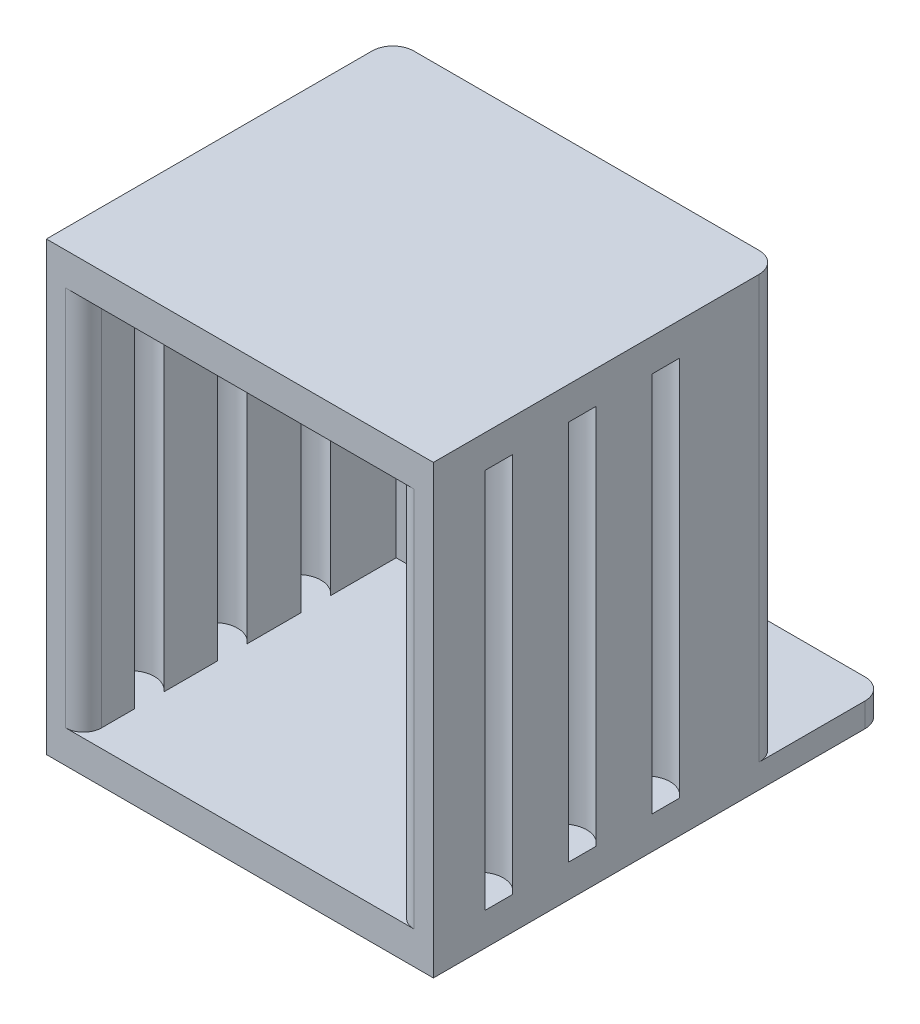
from build123d import *

# Parameters (mm, degrees)
SKETCH1_W          = 33.02
SKETCH1_H          = 29.5656
EXTRUDE1_DEPTH     = 38.1
SKETCH2_W          = 26.67
SKETCH2_H          = 32.512
CUT_EXTRUDE1_DEPTH = 26.67
SKETCH3_W          = 33.02
SKETCH3_H          = 9.0424
EXTRUDE2_DEPTH     = 2.0574
FILLET1_R          = 1.778
SKETCH4_R          = 2.00025
CUT_EXTRUDE2_DEPTH = 16.256
FILLET2_R          = 1.778
FILLET3_R          = 1.524


with BuildPart() as part:
    # Sketch1 → Extrude1 (new body)
    with BuildSketch(Plane(origin=(0, 0, 0), x_dir=(1, 0, 0), z_dir=(0, 1, 0))):
        with Locations((0, 14.7828)):
            Rectangle(SKETCH1_W, SKETCH1_H)
    extrude(amount=EXTRUDE1_DEPTH)

    # Sketch2 → Cut-Extrude1 (cut)
    with BuildSketch(Plane.XY):
        with Locations((0, 19.05)):
            Rectangle(SKETCH2_W, SKETCH2_H)
    extrude(amount=-CUT_EXTRUDE1_DEPTH, mode=Mode.SUBTRACT)

    # Sketch3 → Extrude2 (add)
    with BuildSketch(Plane.XZ):
        with Locations((0, -34.0868)):
            Rectangle(SKETCH3_W, SKETCH3_H)
    extrude(amount=-EXTRUDE2_DEPTH)

    # Fillet1
    fillet1_edges = [part.edges().sort_by_distance(p)[0] for p in [
        (-16.51, 20.0787, -29.5656),
        (16.51, 20.0787, -29.5656),
    ]]
    fillet(fillet1_edges, radius=FILLET1_R)

    # Sketch4 → Cut-Extrude2 (cut, symmetric)
    with BuildSketch(Plane(origin=(0, 19.05, 0), x_dir=(-1, 0, 0), z_dir=(0, 1, 0))):
        with Locations((-14.89075, -5.588)):
            Circle(SKETCH4_R)
        with Locations((-14.89075, -12.7)):
            Circle(SKETCH4_R)
        with Locations((-14.89075, -19.812)):
            Circle(SKETCH4_R)
    cut_extrude2 = extrude(amount=CUT_EXTRUDE2_DEPTH, both=True, mode=Mode.SUBTRACT)

    # Mirror1: Cut-Extrude2 across plane
    add(cut_extrude2.mirror(Plane(origin=(0, 0, 0), x_dir=(0, 0, 1), z_dir=(1, 0, 0))), mode=Mode.SUBTRACT)

    # Fillet2
    fillet2_edges = [part.edges().sort_by_distance(p)[0] for p in [
        (-16.51, 1.0287, -38.608),
        (16.51, 1.0287, -38.608),
    ]]
    fillet(fillet2_edges, radius=FILLET2_R)

    # Fillet3
    fillet3_edges = [part.edges().sort_by_distance(p)[0] for p in [
        (-13.335, 19.05, 0),
        (13.335, 19.05, 0),
    ]]
    fillet(fillet3_edges, radius=FILLET3_R)


solid = part.part
